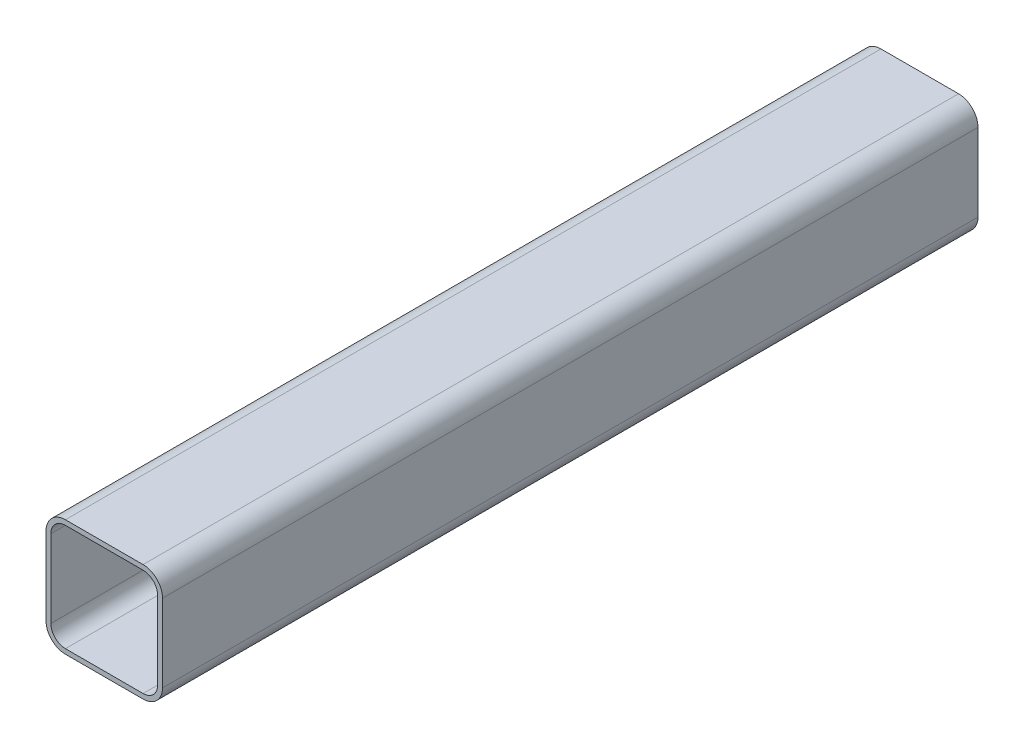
from build123d import *

# Parameters (mm, degrees)
BASE_EXTRUDE_THIN_DEPTH = 533.4


with BuildPart() as part:
    # Sketch1 → Base-Extrude-Thin (new body)
    with BuildSketch(Plane.XY):
        with BuildLine():
            Line((-25.4, 38.1), (25.4, 38.1))
            ThreePointArc((25.4, 38.1), (34.380256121, 34.380256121), (38.1, 25.4))
            Line((38.1, 25.4), (38.1, -25.4))
            ThreePointArc((38.1, -25.4), (34.380256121, -34.380256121), (25.4, -38.1))
            Line((25.4, -38.1), (-25.4, -38.1))
            ThreePointArc((-25.4, -38.1), (-34.380256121, -34.380256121), (-38.1, -25.4))
            Line((-38.1, -25.4), (-38.1, 25.4))
            ThreePointArc((-38.1, 25.4), (-34.380256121, 34.380256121), (-25.4, 38.1))
        make_face()
        with BuildLine():
            Line((-25.4, 34.925), (25.4, 34.925))
            ThreePointArc((25.4, 34.925), (32.135192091, 32.135192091), (34.925, 25.4))
            Line((34.925, 25.4), (34.925, -25.4))
            ThreePointArc((34.925, -25.4), (32.135192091, -32.135192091), (25.4, -34.925))
            Line((25.4, -34.925), (-25.4, -34.925))
            ThreePointArc((-25.4, -34.925), (-32.135192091, -32.135192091), (-34.925, -25.4))
            Line((-34.925, -25.4), (-34.925, 25.4))
            ThreePointArc((-34.925, 25.4), (-32.135192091, 32.135192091), (-25.4, 34.925))
        make_face(mode=Mode.SUBTRACT)
    extrude(amount=BASE_EXTRUDE_THIN_DEPTH)


solid = part.part
